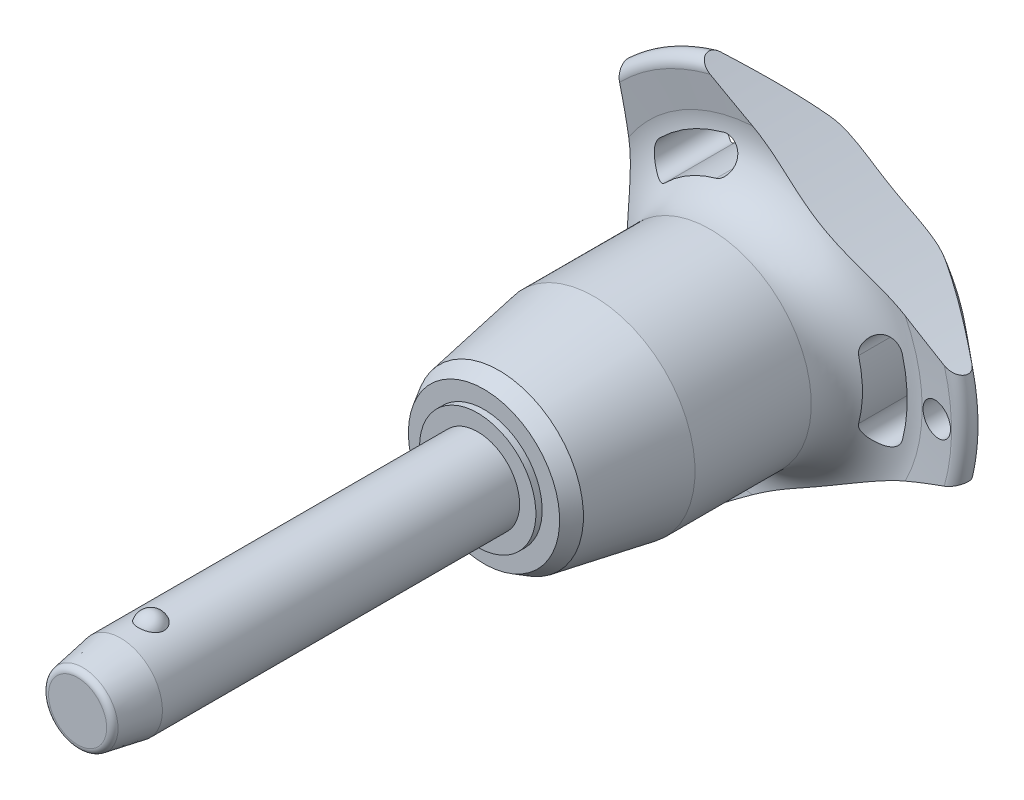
from build123d import *

# Parameters (mm, degrees)
SKETCH1_R           = 4
BOSS_EXTRUDE1_DEPTH = 30
SKETCH2_R           = 3.4
BOSS_EXTRUDE2_DEPTH = 33.3
BOSS_EXTRUDE3_START = 8.2
SKETCH1_2_R         = 4
BOSS_EXTRUDE3_DEPTH = 8.2
CHAMFER1_SIZE       = 4.1
CHAMFER1_SIZE2      = 0.722940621
FILLET1_R           = 0.6
SKETCH6_R           = 102.8
CUT_EXTRUDE1_DEPTH  = 70.10619492
CIRPATTERN1_COUNT   = 3
SKETCH7_R           = 1.5
CUT_EXTRUDE2_DEPTH  = 69.871754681


with BuildPart() as part:
    # Sketch1 → Boss-Extrude1 (new body)
    with BuildSketch(Plane.XY):
        Circle(SKETCH1_R)
    extrude(amount=-BOSS_EXTRUDE1_DEPTH)

    # Sketch2 → Boss-Extrude2 (add)
    with BuildSketch(Plane(origin=(0, 0, -30), x_dir=(-1, 0, 0), z_dir=(0, 0, -1))):
        Circle(SKETCH2_R)
    extrude(amount=BOSS_EXTRUDE2_DEPTH)

    # Sketch3 → Revolve1 (revolve)
    with BuildSketch(Plane(origin=(0, 0, 0), x_dir=(0, 0, -1), z_dir=(1, 0, 0))):
        with BuildLine():
            Line((-1.2, 4.8), (-1.2, 2.2))
            ThreePointArc((-1.2, 2.2), (0.1, 3.5), (-1.2, 4.8))
        make_face()
        with BuildLine():
            Line((-1.2, -2.2), (-1.2, -4.8))
            ThreePointArc((-1.2, -4.8), (0.1, -3.5), (-1.2, -2.2))
        make_face()
    revolve(axis=Axis((0, -2.2, 1.2), (0, 1, 0)))

    # Sketch1_2 → Boss-Extrude3 (add)
    with BuildSketch(Plane.XY.offset(BOSS_EXTRUDE3_START)):
        Circle(SKETCH1_2_R)
    extrude(amount=-BOSS_EXTRUDE3_DEPTH)

    # Chamfer1
    chamfer1_edges = [part.edges().sort_by_distance(p)[0] for p in [
        (-4, 0, 8.2),
    ]]
    chamfer1_side = [part.faces().sort_by_distance(p)[0] for p in [
        (-4, 0, -10.9),
    ]]
    chamfer(chamfer1_edges, length=CHAMFER1_SIZE, length2=CHAMFER1_SIZE2, reference=chamfer1_side[0])

    # Fillet1
    fillet1_edges = [part.edges().sort_by_distance(p)[0] for p in [
        (-3.277059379, 0, 8.2),
        (3.4, 0, -63.3),
    ]]
    fillet(fillet1_edges, radius=FILLET1_R)

    # Sketch4 → Revolve2 (revolve)
    with BuildSketch(Plane(origin=(0, 0, 0), x_dir=(0, 0, -1), z_dir=(1, 0, 0)), mode=Mode.PRIVATE) as revolve2_sk:
        Polygon((30, 0), (30, 5.554101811), (30.6, 5.554101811), (30.6, 7.220004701), (32.042714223, 8.052956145), (41.1, 9.65), (52.2, 9.65), (52.2, 0), align=None)
    revolve(revolve2_sk.sketch.rotate(Axis((0, 0, -52.2), (0, 0, 1)), 90), axis=Axis((0, 0, -52.2), (0, 0, 1)))

    # Sketch5 → Revolve3 (revolve)
    with BuildSketch(Plane(origin=(0, 0, 0), x_dir=(0, 0, -1), z_dir=(1, 0, 0)), mode=Mode.PRIVATE) as revolve3_sk:
        with BuildLine():
            Line((57.16082631, 15.274661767), (56.757834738, 18.475067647))
            ThreePointArc((56.757834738, 18.475067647), (57.349836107, 19.516443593), (58.516044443, 19.24278761))
            Line((58.516044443, 19.24278761), (62.835691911, 14.094832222))
            ThreePointArc((62.835691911, 14.094832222), (63.3, 12.689260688), (62.67067517, 11.349423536))
            ThreePointArc((62.67067517, 11.349423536), (59.033110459, 6.185112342), (57.75, 0))
            Line((57.75, 0), (52.2, 0))
            Line((52.2, 0), (52.2, 9.65))
            ThreePointArc((52.2, 9.65), (55.949887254, 11.342683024), (57.16082631, 15.274661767))
        make_face()
    revolve(revolve3_sk.sketch.rotate(Axis((0, 0, -57.75), (0, 0, 1)), 90), axis=Axis((0, 0, -57.75), (0, 0, 1)))

    # Sketch6 → Cut-Extrude1 (cut, through all)
    with BuildSketch(Plane.XY):
        with Locations((-115.2, 0)):
            Circle(SKETCH6_R)
        with BuildLine():
            ThreePointArc((13.411913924, -3.529271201), (13.868496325, 0), (13.411913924, 3.529271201))
            ThreePointArc((13.411913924, 3.529271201), (11.694200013, 4.531299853), (10.692171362, 2.813585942))
            ThreePointArc((10.692171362, 2.813585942), (11.056165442, 0), (10.692171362, -2.813585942))
            ThreePointArc((10.692171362, -2.813585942), (11.694200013, -4.531299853), (13.411913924, -3.529271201))
        make_face()
    cut_extrude1 = extrude(amount=-CUT_EXTRUDE1_DEPTH, mode=Mode.SUBTRACT)

    # CirPattern1: Cut-Extrude1 ×3 about axis
    cirpattern1_axis = Axis((0, 0, 0), (0, 0, 1))
    for i in range(1, CIRPATTERN1_COUNT):
        add(cut_extrude1.rotate(cirpattern1_axis, i * 360 / CIRPATTERN1_COUNT), mode=Mode.SUBTRACT)

    # Sketch7 → Cut-Extrude2 (cut, through all)
    with BuildSketch(Plane.XY):
        with Locations(Location((16.868496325, 0, 0), (0, 0, 225.467095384))):
            Circle(SKETCH7_R)
    extrude(amount=-CUT_EXTRUDE2_DEPTH, mode=Mode.SUBTRACT)


solid = part.part
